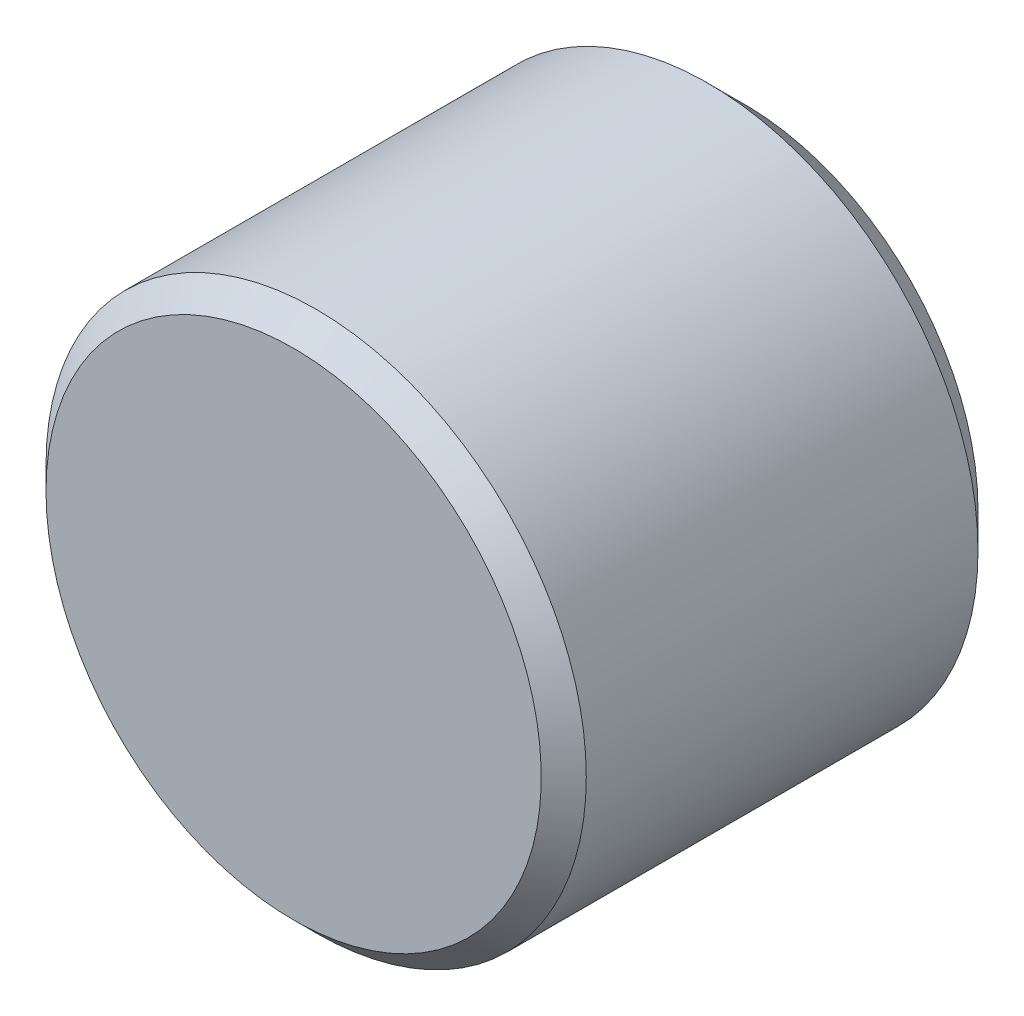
ISO-10303-21;
HEADER;
FILE_DESCRIPTION(('STEP AP214'),'2;1');
FILE_NAME('part.step','',(''),(''),'','','');
FILE_SCHEMA(('AUTOMOTIVE_DESIGN { 1 0 10303 214 1 1 1 1 }'));
ENDSEC;
DATA;
#1=APPLICATION_CONTEXT('core data for automotive mechanical design processes');
#2=APPLICATION_PROTOCOL_DEFINITION('international standard','automotive_design',2000,#1);
#3=PRODUCT_CONTEXT('',#1,'mechanical');
#4=PRODUCT('Part','Part','',(#3));
#5=PRODUCT_RELATED_PRODUCT_CATEGORY('part','',(#4));
#6=PRODUCT_DEFINITION_FORMATION('','',#4);
#7=PRODUCT_DEFINITION_CONTEXT('part definition',#1,'design');
#8=PRODUCT_DEFINITION('design','',#6,#7);
#9=PRODUCT_DEFINITION_SHAPE('','',#8);
#10=(LENGTH_UNIT() NAMED_UNIT(*) SI_UNIT(.MILLI.,.METRE.));
#11=(NAMED_UNIT(*) PLANE_ANGLE_UNIT() SI_UNIT($,.RADIAN.));
#12=(NAMED_UNIT(*) SI_UNIT($,.STERADIAN.) SOLID_ANGLE_UNIT());
#13=UNCERTAINTY_MEASURE_WITH_UNIT(LENGTH_MEASURE(1.E-05),#10,'distance_accuracy_value','');
#14=(GEOMETRIC_REPRESENTATION_CONTEXT(3) GLOBAL_UNCERTAINTY_ASSIGNED_CONTEXT((#13)) GLOBAL_UNIT_ASSIGNED_CONTEXT((#10,
#11,#12)) REPRESENTATION_CONTEXT('',''));
#15=CARTESIAN_POINT('',(0.,0.,0.));
#16=DIRECTION('',(0.,0.,1.));
#17=DIRECTION('',(1.,0.,0.));
#18=AXIS2_PLACEMENT_3D('',#15,#16,#17);
#19=CARTESIAN_POINT('',(0.,0.,30.));
#20=DIRECTION('',(0.,0.,1.));
#21=DIRECTION('',(1.,0.,0.));
#22=AXIS2_PLACEMENT_3D('',#19,#20,#21);
#23=CYLINDRICAL_SURFACE('',#22,6.);
#24=CARTESIAN_POINT('',(0.,0.,0.8));
#25=DIRECTION('',(0.,0.,1.));
#26=DIRECTION('',(1.,0.,0.));
#27=AXIS2_PLACEMENT_3D('',#24,#25,#26);
#28=CIRCLE('',#27,6.);
#29=CARTESIAN_POINT('',(6.,0.,0.8));
#30=VERTEX_POINT('',#29);
#31=EDGE_CURVE('E21',#30,#30,#28,.T.);
#32=ORIENTED_EDGE('',*,*,#31,.T.);
#33=EDGE_LOOP('',(#32));
#34=FACE_BOUND('',#33,.T.);
#35=CARTESIAN_POINT('',(0.,0.,9.5));
#36=DIRECTION('',(0.,0.,-1.));
#37=DIRECTION('',(-1.,0.,0.));
#38=AXIS2_PLACEMENT_3D('',#35,#36,#37);
#39=CIRCLE('',#38,6.);
#40=CARTESIAN_POINT('',(-6.,0.,9.5));
#41=VERTEX_POINT('',#40);
#42=EDGE_CURVE('E27',#41,#41,#39,.T.);
#43=ORIENTED_EDGE('',*,*,#42,.T.);
#44=EDGE_LOOP('',(#43));
#45=FACE_BOUND('',#44,.T.);
#46=ADVANCED_FACE('F13',(#34,#45),#23,.T.);
#47=CARTESIAN_POINT('',(2.5,0.,0.));
#48=DIRECTION('',(0.,0.,1.));
#49=DIRECTION('',(1.,0.,0.));
#50=AXIS2_PLACEMENT_3D('',#47,#48,#49);
#51=PLANE('',#50);
#52=CARTESIAN_POINT('',(0.,0.,0.));
#53=DIRECTION('',(0.,0.,1.));
#54=DIRECTION('',(1.,0.,0.));
#55=AXIS2_PLACEMENT_3D('',#52,#53,#54);
#56=CIRCLE('',#55,5.2);
#57=CARTESIAN_POINT('',(5.2,0.,0.));
#58=VERTEX_POINT('',#57);
#59=EDGE_CURVE('E8',#58,#58,#56,.F.);
#60=ORIENTED_EDGE('',*,*,#59,.T.);
#61=EDGE_LOOP('',(#60));
#62=FACE_BOUND('',#61,.T.);
#63=CARTESIAN_POINT('',(0.,0.,0.));
#64=DIRECTION('',(0.,0.,1.));
#65=DIRECTION('',(1.,0.,0.));
#66=AXIS2_PLACEMENT_3D('',#63,#64,#65);
#67=CIRCLE('',#66,2.5);
#68=CARTESIAN_POINT('',(2.5,0.,0.));
#69=VERTEX_POINT('',#68);
#70=EDGE_CURVE('E38',#69,#69,#67,.T.);
#71=ORIENTED_EDGE('',*,*,#70,.T.);
#72=EDGE_LOOP('',(#71));
#73=FACE_BOUND('',#72,.T.);
#74=ADVANCED_FACE('F62',(#62,#73),#51,.F.);
#75=CARTESIAN_POINT('',(0.,0.,30.));
#76=DIRECTION('',(0.,0.,1.));
#77=DIRECTION('',(1.,0.,0.));
#78=AXIS2_PLACEMENT_3D('',#75,#76,#77);
#79=CYLINDRICAL_SURFACE('',#78,2.5);
#80=ORIENTED_EDGE('',*,*,#70,.F.);
#81=EDGE_LOOP('',(#80));
#82=FACE_BOUND('',#81,.T.);
#83=CARTESIAN_POINT('',(0.,0.,5.));
#84=DIRECTION('',(0.,0.,1.));
#85=DIRECTION('',(1.,0.,0.));
#86=AXIS2_PLACEMENT_3D('',#83,#84,#85);
#87=CIRCLE('',#86,2.5);
#88=CARTESIAN_POINT('',(2.5,0.,5.));
#89=VERTEX_POINT('',#88);
#90=EDGE_CURVE('E42',#89,#89,#87,.T.);
#91=ORIENTED_EDGE('',*,*,#90,.T.);
#92=EDGE_LOOP('',(#91));
#93=FACE_BOUND('',#92,.T.);
#94=ADVANCED_FACE('F47',(#82,#93),#79,.F.);
#95=CARTESIAN_POINT('',(0.,0.,5.));
#96=DIRECTION('',(0.,0.,1.));
#97=DIRECTION('',(1.,0.,0.));
#98=AXIS2_PLACEMENT_3D('',#95,#96,#97);
#99=PLANE('',#98);
#100=ORIENTED_EDGE('',*,*,#90,.F.);
#101=EDGE_LOOP('',(#100));
#102=FACE_BOUND('',#101,.T.);
#103=ADVANCED_FACE('F49',(#102),#99,.F.);
#104=CARTESIAN_POINT('',(6.,0.,10.));
#105=DIRECTION('',(0.,0.,-1.));
#106=DIRECTION('',(-1.,0.,0.));
#107=AXIS2_PLACEMENT_3D('',#104,#105,#106);
#108=PLANE('',#107);
#109=CARTESIAN_POINT('',(0.,0.,10.));
#110=DIRECTION('',(0.,0.,-1.));
#111=DIRECTION('',(-1.,0.,0.));
#112=AXIS2_PLACEMENT_3D('',#109,#110,#111);
#113=CIRCLE('',#112,5.5);
#114=CARTESIAN_POINT('',(-5.5,0.,10.));
#115=VERTEX_POINT('',#114);
#116=EDGE_CURVE('E32',#115,#115,#113,.F.);
#117=ORIENTED_EDGE('',*,*,#116,.T.);
#118=EDGE_LOOP('',(#117));
#119=FACE_BOUND('',#118,.T.);
#120=ADVANCED_FACE('F51',(#119),#108,.F.);
#121=CARTESIAN_POINT('',(0.,0.,10.));
#122=DIRECTION('',(0.,0.,-1.));
#123=DIRECTION('',(-1.,0.,0.));
#124=AXIS2_PLACEMENT_3D('',#121,#122,#123);
#125=CONICAL_SURFACE('',#124,5.5,0.785398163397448);
#126=ORIENTED_EDGE('',*,*,#42,.F.);
#127=EDGE_LOOP('',(#126));
#128=FACE_BOUND('',#127,.T.);
#129=ORIENTED_EDGE('',*,*,#116,.F.);
#130=EDGE_LOOP('',(#129));
#131=FACE_BOUND('',#130,.T.);
#132=ADVANCED_FACE('F59',(#128,#131),#125,.T.);
#133=CARTESIAN_POINT('',(0.,0.,0.8));
#134=DIRECTION('',(0.,0.,1.));
#135=DIRECTION('',(1.,0.,0.));
#136=AXIS2_PLACEMENT_3D('',#133,#134,#135);
#137=CONICAL_SURFACE('',#136,6.,0.78539816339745);
#138=ORIENTED_EDGE('',*,*,#59,.F.);
#139=EDGE_LOOP('',(#138));
#140=FACE_BOUND('',#139,.T.);
#141=ORIENTED_EDGE('',*,*,#31,.F.);
#142=EDGE_LOOP('',(#141));
#143=FACE_BOUND('',#142,.T.);
#144=ADVANCED_FACE('F15',(#140,#143),#137,.T.);
#145=CLOSED_SHELL('',(#46,#74,#94,#103,#120,#132,#144));
#146=MANIFOLD_SOLID_BREP('B1',#145);
#147=ADVANCED_BREP_SHAPE_REPRESENTATION('',(#18,#146),#14);
#148=SHAPE_DEFINITION_REPRESENTATION(#9,#147);
ENDSEC;
END-ISO-10303-21;
